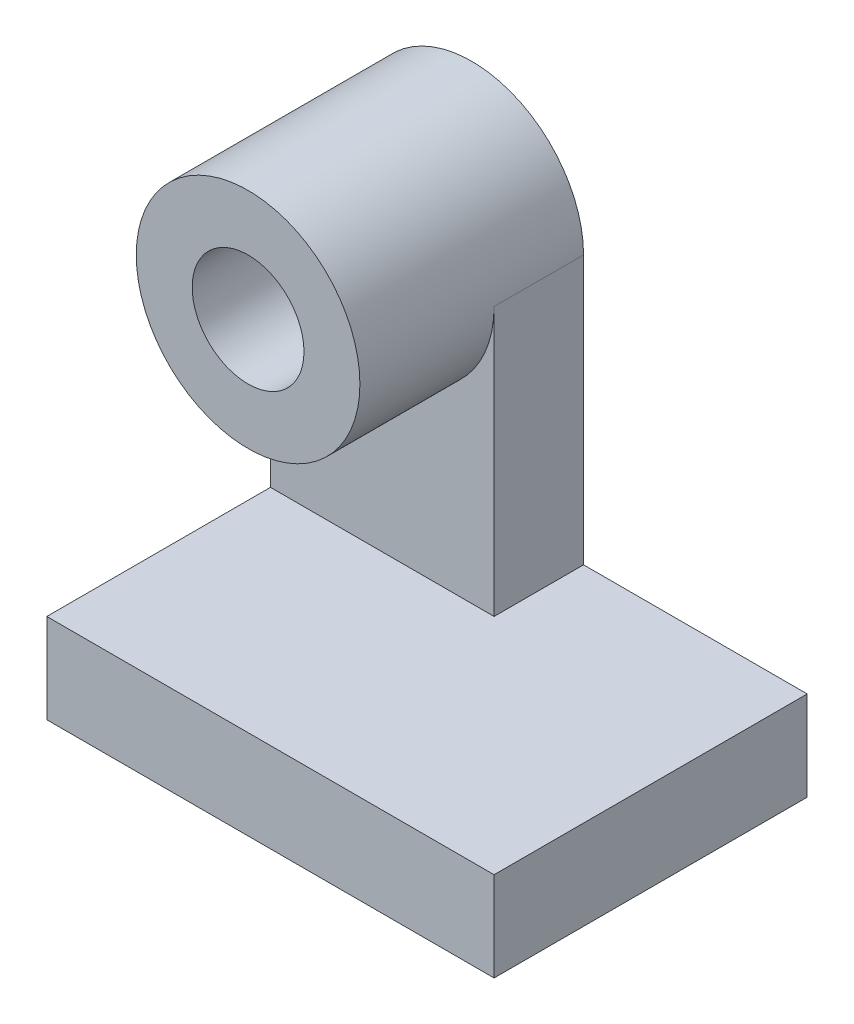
from build123d import *

# Parameters (mm, degrees)
SKETCH1_W           = 127
SKETCH1_H           = 25.4
BOSS_EXTRUDE1_DEPTH = 88.9
BOSS_EXTRUDE2_DEPTH = 25.4
BOSS_EXTRUDE3_DEPTH = 63.5


with BuildPart() as part:
    # Sketch1 → Boss-Extrude1 (new body)
    with BuildSketch(Plane.XY):
        with Locations((63.5, 12.7)):
            Rectangle(SKETCH1_W, SKETCH1_H)
    extrude(amount=BOSS_EXTRUDE1_DEPTH)

    # Sketch1_3 → Boss-Extrude2 (add)
    with BuildSketch(Plane.XY):
        with BuildLine():
            Line((0, 101.6), (0, 25.4))
            Line((0, 25.4), (63.5, 25.4))
            Line((63.5, 25.4), (63.5, 101.6))
            ThreePointArc((63.5, 101.6), (31.75, 69.85), (0, 101.6))
        make_face()
    extrude(amount=BOSS_EXTRUDE2_DEPTH)

    # Sketch1_4 → Boss-Extrude3 (add)
    with BuildSketch(Plane.XY):
        with BuildLine():
            ThreePointArc((63.5, 101.6), (31.75, 133.35), (0, 101.6))
            Line((0, 101.6), (15.875, 101.6))
            ThreePointArc((15.875, 101.6), (31.75, 117.475), (47.625, 101.6))
            Line((47.625, 101.6), (63.5, 101.6))
        make_face()
        with BuildLine():
            Line((15.875, 101.6), (0, 101.6))
            ThreePointArc((0, 101.6), (31.75, 69.85), (63.5, 101.6))
            Line((63.5, 101.6), (47.625, 101.6))
            ThreePointArc((47.625, 101.6), (31.75, 85.725), (15.875, 101.6))
        make_face()
        with BuildLine():
            ThreePointArc((63.5, 101.6), (31.75, 133.35), (0, 101.6))
            Line((0, 101.6), (15.875, 101.6))
            ThreePointArc((15.875, 101.6), (31.75, 117.475), (47.625, 101.6))
            Line((47.625, 101.6), (63.5, 101.6))
        make_face()
        with BuildLine():
            Line((15.875, 101.6), (0, 101.6))
            ThreePointArc((0, 101.6), (31.75, 69.85), (63.5, 101.6))
            Line((63.5, 101.6), (47.625, 101.6))
            ThreePointArc((47.625, 101.6), (31.75, 85.725), (15.875, 101.6))
        make_face()
    extrude(amount=BOSS_EXTRUDE3_DEPTH)


solid = part.part
